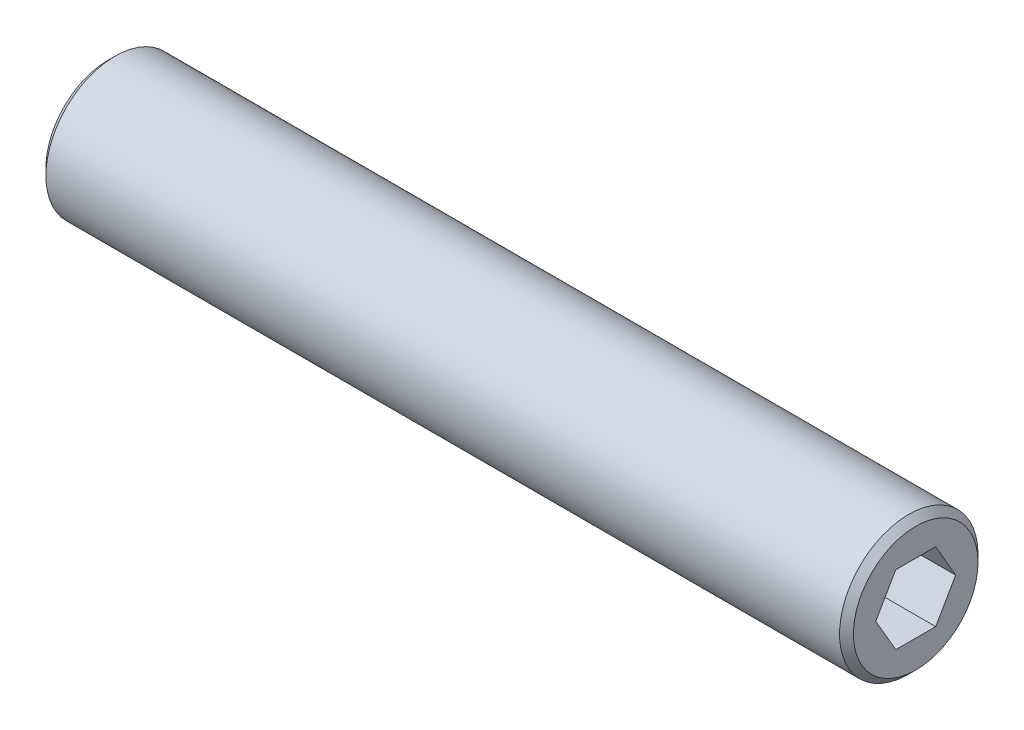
ISO-10303-21;
HEADER;
FILE_DESCRIPTION(('STEP AP214'),'2;1');
FILE_NAME('part.step','',(''),(''),'','','');
FILE_SCHEMA(('AUTOMOTIVE_DESIGN { 1 0 10303 214 1 1 1 1 }'));
ENDSEC;
DATA;
#1=APPLICATION_CONTEXT('core data for automotive mechanical design processes');
#2=APPLICATION_PROTOCOL_DEFINITION('international standard','automotive_design',2000,#1);
#3=PRODUCT_CONTEXT('',#1,'mechanical');
#4=PRODUCT('Part','Part','',(#3));
#5=PRODUCT_RELATED_PRODUCT_CATEGORY('part','',(#4));
#6=PRODUCT_DEFINITION_FORMATION('','',#4);
#7=PRODUCT_DEFINITION_CONTEXT('part definition',#1,'design');
#8=PRODUCT_DEFINITION('design','',#6,#7);
#9=PRODUCT_DEFINITION_SHAPE('','',#8);
#10=(LENGTH_UNIT() NAMED_UNIT(*) SI_UNIT(.MILLI.,.METRE.));
#11=(NAMED_UNIT(*) PLANE_ANGLE_UNIT() SI_UNIT($,.RADIAN.));
#12=(NAMED_UNIT(*) SI_UNIT($,.STERADIAN.) SOLID_ANGLE_UNIT());
#13=UNCERTAINTY_MEASURE_WITH_UNIT(LENGTH_MEASURE(1.E-05),#10,'distance_accuracy_value','');
#14=(GEOMETRIC_REPRESENTATION_CONTEXT(3) GLOBAL_UNCERTAINTY_ASSIGNED_CONTEXT((#13)) GLOBAL_UNIT_ASSIGNED_CONTEXT((#10,
#11,#12)) REPRESENTATION_CONTEXT('',''));
#15=CARTESIAN_POINT('',(0.,0.,0.));
#16=DIRECTION('',(0.,0.,1.));
#17=DIRECTION('',(1.,0.,0.));
#18=AXIS2_PLACEMENT_3D('',#15,#16,#17);
#19=CARTESIAN_POINT('',(17.5,0.,0.));
#20=DIRECTION('',(-1.,0.,0.));
#21=DIRECTION('',(0.,0.,1.));
#22=AXIS2_PLACEMENT_3D('',#19,#20,#21);
#23=CYLINDRICAL_SURFACE('',#22,3.);
#24=CARTESIAN_POINT('',(-17.2,0.,0.));
#25=DIRECTION('',(1.,0.,0.));
#26=DIRECTION('',(0.,0.,-1.));
#27=AXIS2_PLACEMENT_3D('',#24,#25,#26);
#28=CIRCLE('',#27,3.);
#29=CARTESIAN_POINT('',(-17.2,0.,-3.));
#30=VERTEX_POINT('',#29);
#31=EDGE_CURVE('E217',#30,#30,#28,.T.);
#32=ORIENTED_EDGE('',*,*,#31,.T.);
#33=EDGE_LOOP('',(#32));
#34=FACE_BOUND('',#33,.T.);
#35=CARTESIAN_POINT('',(17.2,0.,0.));
#36=DIRECTION('',(1.,0.,0.));
#37=DIRECTION('',(0.,0.,-1.));
#38=AXIS2_PLACEMENT_3D('',#35,#36,#37);
#39=CIRCLE('',#38,3.);
#40=CARTESIAN_POINT('',(17.2,0.,-3.));
#41=VERTEX_POINT('',#40);
#42=EDGE_CURVE('E205',#41,#41,#39,.F.);
#43=ORIENTED_EDGE('',*,*,#42,.T.);
#44=EDGE_LOOP('',(#43));
#45=FACE_BOUND('',#44,.T.);
#46=ADVANCED_FACE('F24',(#34,#45),#23,.T.);
#47=CARTESIAN_POINT('',(17.5,0.,0.));
#48=DIRECTION('',(1.,0.,0.));
#49=DIRECTION('',(0.,0.,-1.));
#50=AXIS2_PLACEMENT_3D('',#47,#48,#49);
#51=PLANE('',#50);
#52=CARTESIAN_POINT('',(17.5,0.,0.));
#53=DIRECTION('',(1.,0.,0.));
#54=DIRECTION('',(0.,0.,-1.));
#55=AXIS2_PLACEMENT_3D('',#52,#53,#54);
#56=CIRCLE('',#55,2.7);
#57=CARTESIAN_POINT('',(17.5,0.,-2.7));
#58=VERTEX_POINT('',#57);
#59=EDGE_CURVE('E11',#58,#58,#56,.T.);
#60=ORIENTED_EDGE('',*,*,#59,.T.);
#61=EDGE_LOOP('',(#60));
#62=FACE_BOUND('',#61,.T.);
#63=DIRECTION('',(0.,0.,1.));
#64=VECTOR('',#63,1.);
#65=CARTESIAN_POINT('',(17.5,1.5,0.866025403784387));
#66=LINE('',#65,#64);
#67=CARTESIAN_POINT('',(17.5,1.50000000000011,-0.866025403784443));
#68=VERTEX_POINT('',#67);
#69=CARTESIAN_POINT('',(17.5,1.5,0.866025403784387));
#70=VERTEX_POINT('',#69);
#71=EDGE_CURVE('E38',#68,#70,#66,.T.);
#72=ORIENTED_EDGE('',*,*,#71,.F.);
#73=DIRECTION('',(0.,0.86602540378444,0.5));
#74=VECTOR('',#73,1.);
#75=CARTESIAN_POINT('',(17.5,1.50000000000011,-0.866025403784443));
#76=LINE('',#75,#74);
#77=CARTESIAN_POINT('',(17.5,0.,-1.73205080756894));
#78=VERTEX_POINT('',#77);
#79=EDGE_CURVE('E142',#78,#68,#76,.T.);
#80=ORIENTED_EDGE('',*,*,#79,.F.);
#81=DIRECTION('',(0.,0.86602540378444,-0.5));
#82=VECTOR('',#81,1.);
#83=CARTESIAN_POINT('',(17.5,0.,-1.73205080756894));
#84=LINE('',#83,#82);
#85=CARTESIAN_POINT('',(17.5,-1.49999999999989,-0.866025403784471));
#86=VERTEX_POINT('',#85);
#87=EDGE_CURVE('E136',#86,#78,#84,.T.);
#88=ORIENTED_EDGE('',*,*,#87,.F.);
#89=DIRECTION('',(0.,0.,-1.));
#90=VECTOR('',#89,1.);
#91=CARTESIAN_POINT('',(17.5,-1.49999999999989,-0.866025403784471));
#92=LINE('',#91,#90);
#93=CARTESIAN_POINT('',(17.5,-1.5,0.866025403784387));
#94=VERTEX_POINT('',#93);
#95=EDGE_CURVE('E134',#94,#86,#92,.T.);
#96=ORIENTED_EDGE('',*,*,#95,.F.);
#97=DIRECTION('',(0.,-0.86602540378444,-0.5));
#98=VECTOR('',#97,1.);
#99=CARTESIAN_POINT('',(17.5,-1.5,0.866025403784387));
#100=LINE('',#99,#98);
#101=CARTESIAN_POINT('',(17.5,0.,1.73205080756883));
#102=VERTEX_POINT('',#101);
#103=EDGE_CURVE('E116',#102,#94,#100,.T.);
#104=ORIENTED_EDGE('',*,*,#103,.F.);
#105=DIRECTION('',(0.,-0.86602540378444,0.5));
#106=VECTOR('',#105,1.);
#107=CARTESIAN_POINT('',(17.5,0.,1.73205080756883));
#108=LINE('',#107,#106);
#109=EDGE_CURVE('E127',#70,#102,#108,.T.);
#110=ORIENTED_EDGE('',*,*,#109,.F.);
#111=EDGE_LOOP('',(#72,#80,#88,#96,#104,#110));
#112=FACE_BOUND('',#111,.T.);
#113=ADVANCED_FACE('F131',(#62,#112),#51,.T.);
#114=CARTESIAN_POINT('',(-17.5,0.,0.));
#115=DIRECTION('',(1.,0.,0.));
#116=DIRECTION('',(0.,0.,-1.));
#117=AXIS2_PLACEMENT_3D('',#114,#115,#116);
#118=PLANE('',#117);
#119=CARTESIAN_POINT('',(-17.5,0.,0.));
#120=DIRECTION('',(1.,0.,0.));
#121=DIRECTION('',(0.,0.,-1.));
#122=AXIS2_PLACEMENT_3D('',#119,#120,#121);
#123=CIRCLE('',#122,2.7);
#124=CARTESIAN_POINT('',(-17.5,0.,-2.7));
#125=VERTEX_POINT('',#124);
#126=EDGE_CURVE('E31',#125,#125,#123,.F.);
#127=ORIENTED_EDGE('',*,*,#126,.T.);
#128=EDGE_LOOP('',(#127));
#129=FACE_BOUND('',#128,.T.);
#130=DIRECTION('',(0.,0.86602540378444,-0.5));
#131=VECTOR('',#130,1.);
#132=CARTESIAN_POINT('',(-17.5,0.,1.73205080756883));
#133=LINE('',#132,#131);
#134=CARTESIAN_POINT('',(-17.5,0.,1.73205080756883));
#135=VERTEX_POINT('',#134);
#136=CARTESIAN_POINT('',(-17.5,1.5,0.866025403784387));
#137=VERTEX_POINT('',#136);
#138=EDGE_CURVE('E169',#135,#137,#133,.T.);
#139=ORIENTED_EDGE('',*,*,#138,.F.);
#140=DIRECTION('',(0.,0.86602540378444,0.5));
#141=VECTOR('',#140,1.);
#142=CARTESIAN_POINT('',(-17.5,-1.5,0.86602540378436));
#143=LINE('',#142,#141);
#144=CARTESIAN_POINT('',(-17.5,-1.5,0.86602540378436));
#145=VERTEX_POINT('',#144);
#146=EDGE_CURVE('E46',#145,#135,#143,.T.);
#147=ORIENTED_EDGE('',*,*,#146,.F.);
#148=DIRECTION('',(0.,0.,1.));
#149=VECTOR('',#148,1.);
#150=CARTESIAN_POINT('',(-17.5,-1.49999999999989,-0.866025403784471));
#151=LINE('',#150,#149);
#152=CARTESIAN_POINT('',(-17.5,-1.49999999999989,-0.866025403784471));
#153=VERTEX_POINT('',#152);
#154=EDGE_CURVE('E181',#153,#145,#151,.T.);
#155=ORIENTED_EDGE('',*,*,#154,.F.);
#156=DIRECTION('',(0.,-0.86602540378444,0.5));
#157=VECTOR('',#156,1.);
#158=CARTESIAN_POINT('',(-17.5,0.,-1.73205080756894));
#159=LINE('',#158,#157);
#160=CARTESIAN_POINT('',(-17.5,0.,-1.73205080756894));
#161=VERTEX_POINT('',#160);
#162=EDGE_CURVE('E178',#161,#153,#159,.T.);
#163=ORIENTED_EDGE('',*,*,#162,.F.);
#164=DIRECTION('',(0.,-0.86602540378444,-0.5));
#165=VECTOR('',#164,1.);
#166=CARTESIAN_POINT('',(-17.5,1.50000000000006,-0.866025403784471));
#167=LINE('',#166,#165);
#168=CARTESIAN_POINT('',(-17.5,1.50000000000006,-0.866025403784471));
#169=VERTEX_POINT('',#168);
#170=EDGE_CURVE('E175',#169,#161,#167,.T.);
#171=ORIENTED_EDGE('',*,*,#170,.F.);
#172=DIRECTION('',(0.,0.,-1.));
#173=VECTOR('',#172,1.);
#174=CARTESIAN_POINT('',(-17.5,1.5,0.866025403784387));
#175=LINE('',#174,#173);
#176=EDGE_CURVE('E172',#137,#169,#175,.T.);
#177=ORIENTED_EDGE('',*,*,#176,.F.);
#178=EDGE_LOOP('',(#139,#147,#155,#163,#171,#177));
#179=FACE_BOUND('',#178,.T.);
#180=ADVANCED_FACE('F222',(#129,#179),#118,.F.);
#181=CARTESIAN_POINT('',(-13.5,-1.5,0.86602540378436));
#182=DIRECTION('',(0.,-0.500000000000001,0.866025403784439));
#183=DIRECTION('',(0.,-0.86602540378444,-0.5));
#184=AXIS2_PLACEMENT_3D('',#181,#182,#183);
#185=PLANE('',#184);
#186=ORIENTED_EDGE('',*,*,#146,.T.);
#187=DIRECTION('',(-1.,0.,0.));
#188=VECTOR('',#187,1.);
#189=CARTESIAN_POINT('',(-13.5,0.,1.73205080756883));
#190=LINE('',#189,#188);
#191=CARTESIAN_POINT('',(-13.5,0.,1.73205080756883));
#192=VERTEX_POINT('',#191);
#193=EDGE_CURVE('E202',#192,#135,#190,.T.);
#194=ORIENTED_EDGE('',*,*,#193,.F.);
#195=DIRECTION('',(0.,0.86602540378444,0.5));
#196=VECTOR('',#195,1.);
#197=CARTESIAN_POINT('',(-13.5,-1.5,0.86602540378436));
#198=LINE('',#197,#196);
#199=CARTESIAN_POINT('',(-13.5,-1.5,0.86602540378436));
#200=VERTEX_POINT('',#199);
#201=EDGE_CURVE('E184',#200,#192,#198,.T.);
#202=ORIENTED_EDGE('',*,*,#201,.F.);
#203=DIRECTION('',(-1.,0.,0.));
#204=VECTOR('',#203,1.);
#205=CARTESIAN_POINT('',(-13.5,-1.5,0.86602540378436));
#206=LINE('',#205,#204);
#207=EDGE_CURVE('E203',#200,#145,#206,.T.);
#208=ORIENTED_EDGE('',*,*,#207,.T.);
#209=EDGE_LOOP('',(#186,#194,#202,#208));
#210=FACE_BOUND('',#209,.T.);
#211=ADVANCED_FACE('F246',(#210),#185,.F.);
#212=CARTESIAN_POINT('',(-13.5,-1.49999999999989,-0.866025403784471));
#213=DIRECTION('',(0.,-1.,0.));
#214=DIRECTION('',(0.,0.,-1.));
#215=AXIS2_PLACEMENT_3D('',#212,#213,#214);
#216=PLANE('',#215);
#217=ORIENTED_EDGE('',*,*,#154,.T.);
#218=ORIENTED_EDGE('',*,*,#207,.F.);
#219=DIRECTION('',(0.,0.,1.));
#220=VECTOR('',#219,1.);
#221=CARTESIAN_POINT('',(-13.5,-1.49999999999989,-0.866025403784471));
#222=LINE('',#221,#220);
#223=CARTESIAN_POINT('',(-13.5,-1.49999999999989,-0.866025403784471));
#224=VERTEX_POINT('',#223);
#225=EDGE_CURVE('E199',#224,#200,#222,.T.);
#226=ORIENTED_EDGE('',*,*,#225,.F.);
#227=DIRECTION('',(-1.,0.,0.));
#228=VECTOR('',#227,1.);
#229=CARTESIAN_POINT('',(-13.5,-1.49999999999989,-0.866025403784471));
#230=LINE('',#229,#228);
#231=EDGE_CURVE('E206',#224,#153,#230,.T.);
#232=ORIENTED_EDGE('',*,*,#231,.T.);
#233=EDGE_LOOP('',(#217,#218,#226,#232));
#234=FACE_BOUND('',#233,.T.);
#235=ADVANCED_FACE('F251',(#234),#216,.F.);
#236=CARTESIAN_POINT('',(-13.5,0.,-1.73205080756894));
#237=DIRECTION('',(0.,-0.500000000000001,-0.866025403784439));
#238=DIRECTION('',(0.,0.86602540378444,-0.5));
#239=AXIS2_PLACEMENT_3D('',#236,#237,#238);
#240=PLANE('',#239);
#241=ORIENTED_EDGE('',*,*,#162,.T.);
#242=ORIENTED_EDGE('',*,*,#231,.F.);
#243=DIRECTION('',(0.,-0.86602540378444,0.5));
#244=VECTOR('',#243,1.);
#245=CARTESIAN_POINT('',(-13.5,0.,-1.73205080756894));
#246=LINE('',#245,#244);
#247=CARTESIAN_POINT('',(-13.5,0.,-1.73205080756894));
#248=VERTEX_POINT('',#247);
#249=EDGE_CURVE('E196',#248,#224,#246,.T.);
#250=ORIENTED_EDGE('',*,*,#249,.F.);
#251=DIRECTION('',(-1.,0.,0.));
#252=VECTOR('',#251,1.);
#253=CARTESIAN_POINT('',(-13.5,0.,-1.73205080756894));
#254=LINE('',#253,#252);
#255=EDGE_CURVE('E208',#248,#161,#254,.T.);
#256=ORIENTED_EDGE('',*,*,#255,.T.);
#257=EDGE_LOOP('',(#241,#242,#250,#256));
#258=FACE_BOUND('',#257,.T.);
#259=ADVANCED_FACE('F264',(#258),#240,.F.);
#260=CARTESIAN_POINT('',(-13.5,1.5,-0.866025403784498));
#261=DIRECTION('',(0.,0.500000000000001,-0.866025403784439));
#262=DIRECTION('',(0.,0.86602540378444,0.5));
#263=AXIS2_PLACEMENT_3D('',#260,#261,#262);
#264=PLANE('',#263);
#265=ORIENTED_EDGE('',*,*,#170,.T.);
#266=ORIENTED_EDGE('',*,*,#255,.F.);
#267=DIRECTION('',(0.,-0.86602540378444,-0.5));
#268=VECTOR('',#267,1.);
#269=CARTESIAN_POINT('',(-13.5,1.5,-0.866025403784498));
#270=LINE('',#269,#268);
#271=CARTESIAN_POINT('',(-13.5,1.5,-0.866025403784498));
#272=VERTEX_POINT('',#271);
#273=EDGE_CURVE('E193',#272,#248,#270,.T.);
#274=ORIENTED_EDGE('',*,*,#273,.F.);
#275=DIRECTION('',(-1.,0.,0.));
#276=VECTOR('',#275,1.);
#277=CARTESIAN_POINT('',(-13.5,1.5,-0.866025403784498));
#278=LINE('',#277,#276);
#279=EDGE_CURVE('E210',#272,#169,#278,.T.);
#280=ORIENTED_EDGE('',*,*,#279,.T.);
#281=EDGE_LOOP('',(#265,#266,#274,#280));
#282=FACE_BOUND('',#281,.T.);
#283=ADVANCED_FACE('F260',(#282),#264,.F.);
#284=CARTESIAN_POINT('',(-13.5,1.5,0.866025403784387));
#285=DIRECTION('',(0.,1.,0.));
#286=DIRECTION('',(0.,0.,1.));
#287=AXIS2_PLACEMENT_3D('',#284,#285,#286);
#288=PLANE('',#287);
#289=ORIENTED_EDGE('',*,*,#176,.T.);
#290=ORIENTED_EDGE('',*,*,#279,.F.);
#291=DIRECTION('',(0.,0.,-1.));
#292=VECTOR('',#291,1.);
#293=CARTESIAN_POINT('',(-13.5,1.5,0.866025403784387));
#294=LINE('',#293,#292);
#295=CARTESIAN_POINT('',(-13.5,1.5,0.866025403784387));
#296=VERTEX_POINT('',#295);
#297=EDGE_CURVE('E190',#296,#272,#294,.T.);
#298=ORIENTED_EDGE('',*,*,#297,.F.);
#299=DIRECTION('',(-1.,0.,0.));
#300=VECTOR('',#299,1.);
#301=CARTESIAN_POINT('',(-13.5,1.5,0.866025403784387));
#302=LINE('',#301,#300);
#303=EDGE_CURVE('E212',#296,#137,#302,.T.);
#304=ORIENTED_EDGE('',*,*,#303,.T.);
#305=EDGE_LOOP('',(#289,#290,#298,#304));
#306=FACE_BOUND('',#305,.T.);
#307=ADVANCED_FACE('F256',(#306),#288,.F.);
#308=CARTESIAN_POINT('',(-13.5,0.,1.73205080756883));
#309=DIRECTION('',(0.,0.500000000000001,0.866025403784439));
#310=DIRECTION('',(0.,-0.86602540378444,0.5));
#311=AXIS2_PLACEMENT_3D('',#308,#309,#310);
#312=PLANE('',#311);
#313=ORIENTED_EDGE('',*,*,#138,.T.);
#314=ORIENTED_EDGE('',*,*,#303,.F.);
#315=DIRECTION('',(0.,0.86602540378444,-0.5));
#316=VECTOR('',#315,1.);
#317=CARTESIAN_POINT('',(-13.5,0.,1.73205080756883));
#318=LINE('',#317,#316);
#319=EDGE_CURVE('E187',#192,#296,#318,.T.);
#320=ORIENTED_EDGE('',*,*,#319,.F.);
#321=ORIENTED_EDGE('',*,*,#193,.T.);
#322=EDGE_LOOP('',(#313,#314,#320,#321));
#323=FACE_BOUND('',#322,.T.);
#324=ADVANCED_FACE('F252',(#323),#312,.F.);
#325=CARTESIAN_POINT('',(-13.5,-1.5,0.86602540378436));
#326=DIRECTION('',(1.,0.,0.));
#327=DIRECTION('',(0.,0.,-1.));
#328=AXIS2_PLACEMENT_3D('',#325,#326,#327);
#329=PLANE('',#328);
#330=ORIENTED_EDGE('',*,*,#201,.T.);
#331=ORIENTED_EDGE('',*,*,#319,.T.);
#332=ORIENTED_EDGE('',*,*,#297,.T.);
#333=ORIENTED_EDGE('',*,*,#273,.T.);
#334=ORIENTED_EDGE('',*,*,#249,.T.);
#335=ORIENTED_EDGE('',*,*,#225,.T.);
#336=EDGE_LOOP('',(#330,#331,#332,#333,#334,#335));
#337=FACE_BOUND('',#336,.T.);
#338=ADVANCED_FACE('F255',(#337),#329,.F.);
#339=CARTESIAN_POINT('',(13.5,1.5,0.866025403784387));
#340=DIRECTION('',(0.,1.,0.));
#341=DIRECTION('',(0.,0.,1.));
#342=AXIS2_PLACEMENT_3D('',#339,#340,#341);
#343=PLANE('',#342);
#344=ORIENTED_EDGE('',*,*,#71,.T.);
#345=DIRECTION('',(1.,0.,0.));
#346=VECTOR('',#345,1.);
#347=CARTESIAN_POINT('',(13.5,1.5,0.866025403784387));
#348=LINE('',#347,#346);
#349=CARTESIAN_POINT('',(13.5,1.5,0.866025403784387));
#350=VERTEX_POINT('',#349);
#351=EDGE_CURVE('E124',#350,#70,#348,.T.);
#352=ORIENTED_EDGE('',*,*,#351,.F.);
#353=DIRECTION('',(0.,0.,1.));
#354=VECTOR('',#353,1.);
#355=CARTESIAN_POINT('',(13.5,1.5,0.866025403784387));
#356=LINE('',#355,#354);
#357=CARTESIAN_POINT('',(13.5,1.50000000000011,-0.866025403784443));
#358=VERTEX_POINT('',#357);
#359=EDGE_CURVE('E145',#358,#350,#356,.T.);
#360=ORIENTED_EDGE('',*,*,#359,.F.);
#361=DIRECTION('',(1.,0.,0.));
#362=VECTOR('',#361,1.);
#363=CARTESIAN_POINT('',(13.5,1.50000000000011,-0.866025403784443));
#364=LINE('',#363,#362);
#365=EDGE_CURVE('E160',#358,#68,#364,.T.);
#366=ORIENTED_EDGE('',*,*,#365,.T.);
#367=EDGE_LOOP('',(#344,#352,#360,#366));
#368=FACE_BOUND('',#367,.T.);
#369=ADVANCED_FACE('F274',(#368),#343,.F.);
#370=CARTESIAN_POINT('',(13.5,1.50000000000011,-0.866025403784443));
#371=DIRECTION('',(0.,0.500000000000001,-0.866025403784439));
#372=DIRECTION('',(0.,0.86602540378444,0.5));
#373=AXIS2_PLACEMENT_3D('',#370,#371,#372);
#374=PLANE('',#373);
#375=ORIENTED_EDGE('',*,*,#79,.T.);
#376=ORIENTED_EDGE('',*,*,#365,.F.);
#377=DIRECTION('',(0.,0.86602540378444,0.5));
#378=VECTOR('',#377,1.);
#379=CARTESIAN_POINT('',(13.5,1.50000000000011,-0.866025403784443));
#380=LINE('',#379,#378);
#381=CARTESIAN_POINT('',(13.5,0.,-1.73205080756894));
#382=VERTEX_POINT('',#381);
#383=EDGE_CURVE('E157',#382,#358,#380,.T.);
#384=ORIENTED_EDGE('',*,*,#383,.F.);
#385=DIRECTION('',(1.,0.,0.));
#386=VECTOR('',#385,1.);
#387=CARTESIAN_POINT('',(13.5,0.,-1.73205080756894));
#388=LINE('',#387,#386);
#389=EDGE_CURVE('E162',#382,#78,#388,.T.);
#390=ORIENTED_EDGE('',*,*,#389,.T.);
#391=EDGE_LOOP('',(#375,#376,#384,#390));
#392=FACE_BOUND('',#391,.T.);
#393=ADVANCED_FACE('F278',(#392),#374,.F.);
#394=CARTESIAN_POINT('',(13.5,0.,-1.73205080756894));
#395=DIRECTION('',(0.,-0.500000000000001,-0.866025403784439));
#396=DIRECTION('',(0.,0.86602540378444,-0.5));
#397=AXIS2_PLACEMENT_3D('',#394,#395,#396);
#398=PLANE('',#397);
#399=ORIENTED_EDGE('',*,*,#87,.T.);
#400=ORIENTED_EDGE('',*,*,#389,.F.);
#401=DIRECTION('',(0.,0.86602540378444,-0.5));
#402=VECTOR('',#401,1.);
#403=CARTESIAN_POINT('',(13.5,0.,-1.73205080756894));
#404=LINE('',#403,#402);
#405=CARTESIAN_POINT('',(13.5,-1.49999999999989,-0.866025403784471));
#406=VERTEX_POINT('',#405);
#407=EDGE_CURVE('E154',#406,#382,#404,.T.);
#408=ORIENTED_EDGE('',*,*,#407,.F.);
#409=DIRECTION('',(1.,0.,0.));
#410=VECTOR('',#409,1.);
#411=CARTESIAN_POINT('',(13.5,-1.49999999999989,-0.866025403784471));
#412=LINE('',#411,#410);
#413=EDGE_CURVE('E164',#406,#86,#412,.T.);
#414=ORIENTED_EDGE('',*,*,#413,.T.);
#415=EDGE_LOOP('',(#399,#400,#408,#414));
#416=FACE_BOUND('',#415,.T.);
#417=ADVANCED_FACE('F286',(#416),#398,.F.);
#418=CARTESIAN_POINT('',(13.5,-1.49999999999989,-0.866025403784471));
#419=DIRECTION('',(0.,-1.,0.));
#420=DIRECTION('',(0.,0.,-1.));
#421=AXIS2_PLACEMENT_3D('',#418,#419,#420);
#422=PLANE('',#421);
#423=ORIENTED_EDGE('',*,*,#95,.T.);
#424=ORIENTED_EDGE('',*,*,#413,.F.);
#425=DIRECTION('',(0.,0.,-1.));
#426=VECTOR('',#425,1.);
#427=CARTESIAN_POINT('',(13.5,-1.49999999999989,-0.866025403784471));
#428=LINE('',#427,#426);
#429=CARTESIAN_POINT('',(13.5,-1.5,0.866025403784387));
#430=VERTEX_POINT('',#429);
#431=EDGE_CURVE('E151',#430,#406,#428,.T.);
#432=ORIENTED_EDGE('',*,*,#431,.F.);
#433=DIRECTION('',(1.,0.,0.));
#434=VECTOR('',#433,1.);
#435=CARTESIAN_POINT('',(13.5,-1.5,0.866025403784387));
#436=LINE('',#435,#434);
#437=EDGE_CURVE('E123',#430,#94,#436,.T.);
#438=ORIENTED_EDGE('',*,*,#437,.T.);
#439=EDGE_LOOP('',(#423,#424,#432,#438));
#440=FACE_BOUND('',#439,.T.);
#441=ADVANCED_FACE('F283',(#440),#422,.F.);
#442=CARTESIAN_POINT('',(13.5,-1.5,0.866025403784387));
#443=DIRECTION('',(0.,-0.500000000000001,0.866025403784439));
#444=DIRECTION('',(0.,-0.86602540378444,-0.5));
#445=AXIS2_PLACEMENT_3D('',#442,#443,#444);
#446=PLANE('',#445);
#447=ORIENTED_EDGE('',*,*,#103,.T.);
#448=ORIENTED_EDGE('',*,*,#437,.F.);
#449=DIRECTION('',(0.,-0.86602540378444,-0.5));
#450=VECTOR('',#449,1.);
#451=CARTESIAN_POINT('',(13.5,-1.5,0.866025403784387));
#452=LINE('',#451,#450);
#453=CARTESIAN_POINT('',(13.5,0.,1.73205080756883));
#454=VERTEX_POINT('',#453);
#455=EDGE_CURVE('E119',#454,#430,#452,.T.);
#456=ORIENTED_EDGE('',*,*,#455,.F.);
#457=DIRECTION('',(1.,0.,0.));
#458=VECTOR('',#457,1.);
#459=CARTESIAN_POINT('',(13.5,0.,1.73205080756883));
#460=LINE('',#459,#458);
#461=EDGE_CURVE('E112',#454,#102,#460,.T.);
#462=ORIENTED_EDGE('',*,*,#461,.T.);
#463=EDGE_LOOP('',(#447,#448,#456,#462));
#464=FACE_BOUND('',#463,.T.);
#465=ADVANCED_FACE('F114',(#464),#446,.F.);
#466=CARTESIAN_POINT('',(13.5,0.,1.73205080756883));
#467=DIRECTION('',(0.,0.500000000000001,0.866025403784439));
#468=DIRECTION('',(0.,-0.86602540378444,0.5));
#469=AXIS2_PLACEMENT_3D('',#466,#467,#468);
#470=PLANE('',#469);
#471=ORIENTED_EDGE('',*,*,#109,.T.);
#472=ORIENTED_EDGE('',*,*,#461,.F.);
#473=DIRECTION('',(0.,-0.86602540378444,0.5));
#474=VECTOR('',#473,1.);
#475=CARTESIAN_POINT('',(13.5,0.,1.73205080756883));
#476=LINE('',#475,#474);
#477=EDGE_CURVE('E148',#350,#454,#476,.T.);
#478=ORIENTED_EDGE('',*,*,#477,.F.);
#479=ORIENTED_EDGE('',*,*,#351,.T.);
#480=EDGE_LOOP('',(#471,#472,#478,#479));
#481=FACE_BOUND('',#480,.T.);
#482=ADVANCED_FACE('F128',(#481),#470,.F.);
#483=CARTESIAN_POINT('',(13.5,1.50000000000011,2.59807621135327));
#484=DIRECTION('',(1.,0.,0.));
#485=DIRECTION('',(0.,0.,-1.));
#486=AXIS2_PLACEMENT_3D('',#483,#484,#485);
#487=PLANE('',#486);
#488=ORIENTED_EDGE('',*,*,#359,.T.);
#489=ORIENTED_EDGE('',*,*,#477,.T.);
#490=ORIENTED_EDGE('',*,*,#455,.T.);
#491=ORIENTED_EDGE('',*,*,#431,.T.);
#492=ORIENTED_EDGE('',*,*,#407,.T.);
#493=ORIENTED_EDGE('',*,*,#383,.T.);
#494=EDGE_LOOP('',(#488,#489,#490,#491,#492,#493));
#495=FACE_BOUND('',#494,.T.);
#496=ADVANCED_FACE('F229',(#495),#487,.T.);
#497=CARTESIAN_POINT('',(-17.2,0.,0.));
#498=DIRECTION('',(1.,0.,0.));
#499=DIRECTION('',(0.,0.,-1.));
#500=AXIS2_PLACEMENT_3D('',#497,#498,#499);
#501=CONICAL_SURFACE('',#500,3.,0.785398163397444);
#502=ORIENTED_EDGE('',*,*,#126,.F.);
#503=EDGE_LOOP('',(#502));
#504=FACE_BOUND('',#503,.T.);
#505=ORIENTED_EDGE('',*,*,#31,.F.);
#506=EDGE_LOOP('',(#505));
#507=FACE_BOUND('',#506,.T.);
#508=ADVANCED_FACE('F225',(#504,#507),#501,.T.);
#509=CARTESIAN_POINT('',(17.5,0.,0.));
#510=DIRECTION('',(-1.,0.,0.));
#511=DIRECTION('',(0.,0.,1.));
#512=AXIS2_PLACEMENT_3D('',#509,#510,#511);
#513=CONICAL_SURFACE('',#512,2.7,0.785398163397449);
#514=ORIENTED_EDGE('',*,*,#42,.F.);
#515=EDGE_LOOP('',(#514));
#516=FACE_BOUND('',#515,.T.);
#517=ORIENTED_EDGE('',*,*,#59,.F.);
#518=EDGE_LOOP('',(#517));
#519=FACE_BOUND('',#518,.T.);
#520=ADVANCED_FACE('F228',(#516,#519),#513,.T.);
#521=CLOSED_SHELL('',(#46,#113,#180,#211,#235,#259,#283,#307,#324,#338,#369,#393,#417,#441,#465,
#482,#496,#508,#520));
#522=MANIFOLD_SOLID_BREP('B2',#521);
#523=ADVANCED_BREP_SHAPE_REPRESENTATION('',(#18,#522),#14);
#524=SHAPE_DEFINITION_REPRESENTATION(#9,#523);
ENDSEC;
END-ISO-10303-21;
